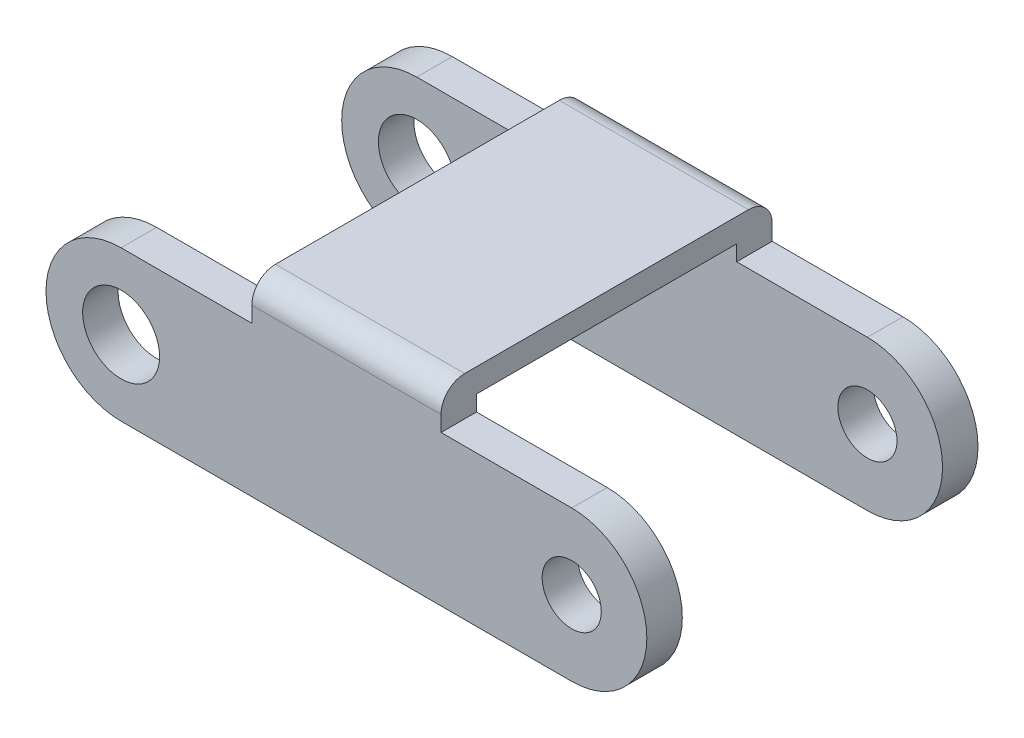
from build123d import *

# Parameters (mm, degrees)
SKETCH1_R           = 3.25
SKETCH1_R_2         = 2.5
BOSS_EXTRUDE1_DEPTH = 3
BOSS_EXTRUDE2_DEPTH = 8


with BuildPart() as part:
    # Sketch1 → Boss-Extrude1 (new body)
    with BuildSketch(Plane.XY):
        with BuildLine():
            Line((-19.05, 8.562258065), (19.05, 8.562258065))
            ThreePointArc((19.05, 8.562258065), (25.4, 2.212258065), (19.05, -4.137741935))
            Line((19.05, -4.137741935), (-19.05, -4.137741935))
            ThreePointArc((-19.05, -4.137741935), (-25.4, 2.212258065), (-19.05, 8.562258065))
        make_face()
        with Locations((-19.05, 2.212258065)):
            Circle(SKETCH1_R, mode=Mode.SUBTRACT)
        with Locations((19.05, 2.212258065)):
            Circle(SKETCH1_R_2, mode=Mode.SUBTRACT)
    boss_extrude1 = extrude(amount=-BOSS_EXTRUDE1_DEPTH)

    # Sketch2 → Boss-Extrude2 (add, symmetric)
    with BuildSketch(Plane(origin=(0, 0, 0), x_dir=(0, 0, -1), z_dir=(1, 0, 0))):
        with BuildLine():
            Line((3, 8.562258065), (3, 9.882258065))
            Line((3, 9.882258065), (14, 9.882258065))
            Line((14, 9.882258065), (14, 11.882258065))
            Line((14, 11.882258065), (2, 11.882258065))
            ThreePointArc((2, 11.882258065), (0.585786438, 11.296471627), (0, 9.882258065))
            Line((0, 9.882258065), (0, 8.562258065))
            Line((0, 8.562258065), (3, 8.562258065))
        make_face()
    boss_extrude2 = extrude(amount=BOSS_EXTRUDE2_DEPTH, both=True)

    # Mirror2: Boss-Extrude2 across plane
    add(boss_extrude2.mirror(Plane(origin=(0, 0, -14), x_dir=(1, 0, 0), z_dir=(0, 0, -1))))

    # Mirror3: Boss-Extrude1 across plane
    add(boss_extrude1.mirror(Plane(origin=(0, 0, -14), x_dir=(1, 0, 0), z_dir=(0, 0, -1))))


solid = part.part
